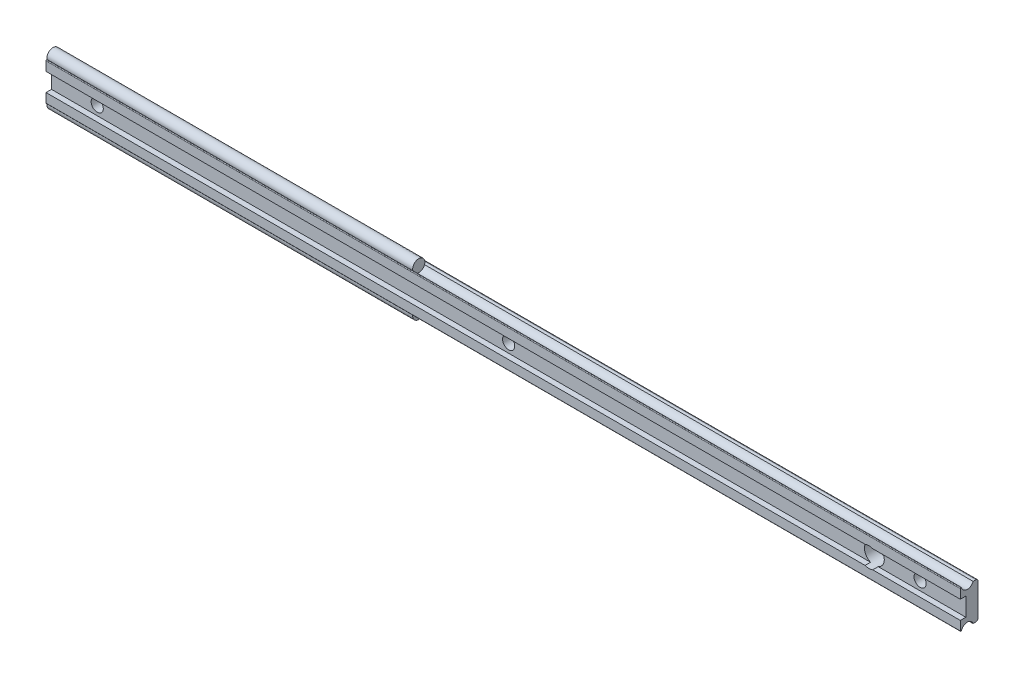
ISO-10303-21;
HEADER;
FILE_DESCRIPTION(('STEP AP214'),'2;1');
FILE_NAME('part.step','',(''),(''),'','','');
FILE_SCHEMA(('AUTOMOTIVE_DESIGN { 1 0 10303 214 1 1 1 1 }'));
ENDSEC;
DATA;
#1=APPLICATION_CONTEXT('core data for automotive mechanical design processes');
#2=APPLICATION_PROTOCOL_DEFINITION('international standard','automotive_design',2000,#1);
#3=PRODUCT_CONTEXT('',#1,'mechanical');
#4=PRODUCT('Part','Part','',(#3));
#5=PRODUCT_RELATED_PRODUCT_CATEGORY('part','',(#4));
#6=PRODUCT_DEFINITION_FORMATION('','',#4);
#7=PRODUCT_DEFINITION_CONTEXT('part definition',#1,'design');
#8=PRODUCT_DEFINITION('design','',#6,#7);
#9=PRODUCT_DEFINITION_SHAPE('','',#8);
#10=(LENGTH_UNIT() NAMED_UNIT(*) SI_UNIT(.MILLI.,.METRE.));
#11=(NAMED_UNIT(*) PLANE_ANGLE_UNIT() SI_UNIT($,.RADIAN.));
#12=(NAMED_UNIT(*) SI_UNIT($,.STERADIAN.) SOLID_ANGLE_UNIT());
#13=UNCERTAINTY_MEASURE_WITH_UNIT(LENGTH_MEASURE(1.E-05),#10,'distance_accuracy_value','');
#14=(GEOMETRIC_REPRESENTATION_CONTEXT(3) GLOBAL_UNCERTAINTY_ASSIGNED_CONTEXT((#13)) GLOBAL_UNIT_ASSIGNED_CONTEXT((#10,
#11,#12)) REPRESENTATION_CONTEXT('',''));
#15=CARTESIAN_POINT('',(0.,0.,0.));
#16=DIRECTION('',(0.,0.,1.));
#17=DIRECTION('',(1.,0.,0.));
#18=AXIS2_PLACEMENT_3D('',#15,#16,#17);
#19=CARTESIAN_POINT('',(-15.,-6.65000008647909,3.5000001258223));
#20=DIRECTION('',(1.,0.,0.));
#21=DIRECTION('',(0.,0.,-1.));
#22=AXIS2_PLACEMENT_3D('',#19,#20,#21);
#23=CYLINDRICAL_SURFACE('',#22,2.00000010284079);
#24=DIRECTION('',(1.,0.,0.));
#25=VECTOR('',#24,1.);
#26=CARTESIAN_POINT('',(-15.,-6.19000011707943,5.4463814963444));
#27=LINE('',#26,#25);
#28=CARTESIAN_POINT('',(105.,-6.19000011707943,5.4463814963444));
#29=VERTEX_POINT('',#28);
#30=CARTESIAN_POINT('',(285.,-6.19000011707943,5.4463814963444));
#31=VERTEX_POINT('',#30);
#32=EDGE_CURVE('E36',#29,#31,#27,.T.);
#33=ORIENTED_EDGE('',*,*,#32,.F.);
#34=CARTESIAN_POINT('',(105.,-6.65000008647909,3.5000001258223));
#35=DIRECTION('',(-1.,0.,0.));
#36=DIRECTION('',(0.,0.,1.));
#37=AXIS2_PLACEMENT_3D('',#34,#35,#36);
#38=CIRCLE('',#37,2.00000010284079);
#39=CARTESIAN_POINT('',(105.,-6.00000004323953,1.60857199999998));
#40=VERTEX_POINT('',#39);
#41=EDGE_CURVE('E31',#29,#40,#38,.T.);
#42=ORIENTED_EDGE('',*,*,#41,.T.);
#43=DIRECTION('',(1.,0.,0.));
#44=VECTOR('',#43,1.);
#45=CARTESIAN_POINT('',(-15.,-6.00000004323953,1.60857199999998));
#46=LINE('',#45,#44);
#47=CARTESIAN_POINT('',(285.,-6.00000004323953,1.60857199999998));
#48=VERTEX_POINT('',#47);
#49=EDGE_CURVE('E181',#40,#48,#46,.T.);
#50=ORIENTED_EDGE('',*,*,#49,.T.);
#51=CARTESIAN_POINT('',(285.,-6.65000008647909,3.5000001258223));
#52=DIRECTION('',(-1.,0.,0.));
#53=DIRECTION('',(0.,0.,1.));
#54=AXIS2_PLACEMENT_3D('',#51,#52,#53);
#55=CIRCLE('',#54,2.00000010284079);
#56=EDGE_CURVE('E267',#31,#48,#55,.T.);
#57=ORIENTED_EDGE('',*,*,#56,.F.);
#58=EDGE_LOOP('',(#33,#42,#50,#57));
#59=FACE_BOUND('',#58,.T.);
#60=ADVANCED_FACE('F14',(#59),#23,.F.);
#61=CARTESIAN_POINT('',(-15.,6.65000008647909,3.5000001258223));
#62=DIRECTION('',(1.,0.,0.));
#63=DIRECTION('',(0.,0.,-1.));
#64=AXIS2_PLACEMENT_3D('',#61,#62,#63);
#65=CYLINDRICAL_SURFACE('',#64,2.00000010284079);
#66=DIRECTION('',(1.,0.,0.));
#67=VECTOR('',#66,1.);
#68=CARTESIAN_POINT('',(-15.,6.00000004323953,1.60857199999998));
#69=LINE('',#68,#67);
#70=CARTESIAN_POINT('',(105.,6.00000004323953,1.60857199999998));
#71=VERTEX_POINT('',#70);
#72=CARTESIAN_POINT('',(285.,6.00000004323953,1.60857199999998));
#73=VERTEX_POINT('',#72);
#74=EDGE_CURVE('E348',#71,#73,#69,.T.);
#75=ORIENTED_EDGE('',*,*,#74,.F.);
#76=CARTESIAN_POINT('',(105.,6.65000008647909,3.5000001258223));
#77=DIRECTION('',(-1.,0.,0.));
#78=DIRECTION('',(0.,0.,1.));
#79=AXIS2_PLACEMENT_3D('',#76,#77,#78);
#80=CIRCLE('',#79,2.00000010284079);
#81=CARTESIAN_POINT('',(105.,6.19000011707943,5.4463814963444));
#82=VERTEX_POINT('',#81);
#83=EDGE_CURVE('E194',#71,#82,#80,.T.);
#84=ORIENTED_EDGE('',*,*,#83,.T.);
#85=DIRECTION('',(1.,0.,0.));
#86=VECTOR('',#85,1.);
#87=CARTESIAN_POINT('',(-15.,6.19000011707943,5.4463814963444));
#88=LINE('',#87,#86);
#89=CARTESIAN_POINT('',(285.,6.19000011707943,5.4463814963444));
#90=VERTEX_POINT('',#89);
#91=EDGE_CURVE('E344',#82,#90,#88,.T.);
#92=ORIENTED_EDGE('',*,*,#91,.T.);
#93=CARTESIAN_POINT('',(285.,6.65000008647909,3.5000001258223));
#94=DIRECTION('',(-1.,0.,0.));
#95=DIRECTION('',(0.,0.,-1.));
#96=AXIS2_PLACEMENT_3D('',#93,#94,#95);
#97=CIRCLE('',#96,2.00000010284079);
#98=EDGE_CURVE('E237',#73,#90,#97,.T.);
#99=ORIENTED_EDGE('',*,*,#98,.F.);
#100=EDGE_LOOP('',(#75,#84,#92,#99));
#101=FACE_BOUND('',#100,.T.);
#102=ADVANCED_FACE('F409',(#101),#65,.F.);
#103=CARTESIAN_POINT('',(-15.,-3.00000011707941,5.79999999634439));
#104=DIRECTION('',(0.,1.,0.));
#105=DIRECTION('',(0.,0.,1.));
#106=AXIS2_PLACEMENT_3D('',#103,#104,#105);
#107=PLANE('',#106);
#108=DIRECTION('',(0.,0.,-1.));
#109=VECTOR('',#108,1.);
#110=CARTESIAN_POINT('',(256.24999971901,-3.00000011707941,5.7999999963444));
#111=LINE('',#110,#109);
#112=CARTESIAN_POINT('',(256.24999971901,-3.00000011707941,5.7999999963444));
#113=VERTEX_POINT('',#112);
#114=CARTESIAN_POINT('',(256.24999971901,-3.00000011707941,3.99999999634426));
#115=VERTEX_POINT('',#114);
#116=EDGE_CURVE('E224',#113,#115,#111,.T.);
#117=ORIENTED_EDGE('',*,*,#116,.F.);
#118=DIRECTION('',(1.,0.,0.));
#119=VECTOR('',#118,1.);
#120=CARTESIAN_POINT('',(-15.,-3.00000011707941,5.79999999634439));
#121=LINE('',#120,#119);
#122=CARTESIAN_POINT('',(285.,-3.00000011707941,5.79999999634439));
#123=VERTEX_POINT('',#122);
#124=EDGE_CURVE('E324',#113,#123,#121,.T.);
#125=ORIENTED_EDGE('',*,*,#124,.T.);
#126=DIRECTION('',(0.,0.,1.));
#127=VECTOR('',#126,1.);
#128=CARTESIAN_POINT('',(285.,-3.00000011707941,5.79999999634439));
#129=LINE('',#128,#127);
#130=CARTESIAN_POINT('',(285.,-3.00000011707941,3.99999999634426));
#131=VERTEX_POINT('',#130);
#132=EDGE_CURVE('E255',#131,#123,#129,.T.);
#133=ORIENTED_EDGE('',*,*,#132,.F.);
#134=DIRECTION('',(1.,0.,0.));
#135=VECTOR('',#134,1.);
#136=CARTESIAN_POINT('',(-15.,-3.00000011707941,3.99999999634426));
#137=LINE('',#136,#135);
#138=EDGE_CURVE('E328',#115,#131,#137,.T.);
#139=ORIENTED_EDGE('',*,*,#138,.F.);
#140=EDGE_LOOP('',(#117,#125,#133,#139));
#141=FACE_BOUND('',#140,.T.);
#142=ADVANCED_FACE('F416',(#141),#107,.T.);
#143=CARTESIAN_POINT('',(-15.,-3.00000011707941,3.99999999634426));
#144=DIRECTION('',(0.,0.,1.));
#145=DIRECTION('',(0.,-1.,0.));
#146=AXIS2_PLACEMENT_3D('',#143,#144,#145);
#147=PLANE('',#146);
#148=CARTESIAN_POINT('',(270.,0.,3.99999999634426));
#149=DIRECTION('',(0.,0.,1.));
#150=DIRECTION('',(0.,-1.,0.));
#151=AXIS2_PLACEMENT_3D('',#148,#149,#150);
#152=CIRCLE('',#151,2.);
#153=CARTESIAN_POINT('',(270.,-2.,3.99999999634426));
#154=VERTEX_POINT('',#153);
#155=EDGE_CURVE('E210',#154,#154,#152,.T.);
#156=ORIENTED_EDGE('',*,*,#155,.F.);
#157=EDGE_LOOP('',(#156));
#158=FACE_BOUND('',#157,.T.);
#159=CARTESIAN_POINT('',(255.,0.,3.99999999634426));
#160=DIRECTION('',(0.,0.,1.));
#161=DIRECTION('',(0.,-1.,0.));
#162=AXIS2_PLACEMENT_3D('',#159,#160,#161);
#163=CIRCLE('',#162,3.25);
#164=CARTESIAN_POINT('',(256.24999971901,3.00000011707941,3.99999999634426));
#165=VERTEX_POINT('',#164);
#166=EDGE_CURVE('E222',#115,#165,#163,.T.);
#167=ORIENTED_EDGE('',*,*,#166,.F.);
#168=ORIENTED_EDGE('',*,*,#138,.T.);
#169=DIRECTION('',(0.,-1.,0.));
#170=VECTOR('',#169,1.);
#171=CARTESIAN_POINT('',(285.,-3.00000011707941,3.99999999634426));
#172=LINE('',#171,#170);
#173=CARTESIAN_POINT('',(285.,3.00000011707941,3.99999999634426));
#174=VERTEX_POINT('',#173);
#175=EDGE_CURVE('E252',#174,#131,#172,.T.);
#176=ORIENTED_EDGE('',*,*,#175,.F.);
#177=DIRECTION('',(1.,0.,0.));
#178=VECTOR('',#177,1.);
#179=CARTESIAN_POINT('',(-15.,3.00000011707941,3.99999999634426));
#180=LINE('',#179,#178);
#181=EDGE_CURVE('E332',#165,#174,#180,.T.);
#182=ORIENTED_EDGE('',*,*,#181,.F.);
#183=EDGE_LOOP('',(#167,#168,#176,#182));
#184=FACE_BOUND('',#183,.T.);
#185=ADVANCED_FACE('F364',(#158,#184),#147,.T.);
#186=CARTESIAN_POINT('',(-15.,3.00000011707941,5.7999999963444));
#187=DIRECTION('',(0.,-1.,0.));
#188=DIRECTION('',(0.,0.,-1.));
#189=AXIS2_PLACEMENT_3D('',#186,#187,#188);
#190=PLANE('',#189);
#191=DIRECTION('',(0.,0.,-1.));
#192=VECTOR('',#191,1.);
#193=CARTESIAN_POINT('',(253.75000028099,3.00000011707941,5.7999999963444));
#194=LINE('',#193,#192);
#195=CARTESIAN_POINT('',(253.75000028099,3.00000011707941,5.7999999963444));
#196=VERTEX_POINT('',#195);
#197=CARTESIAN_POINT('',(253.75000028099,3.00000011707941,3.99999999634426));
#198=VERTEX_POINT('',#197);
#199=EDGE_CURVE('E227',#196,#198,#194,.T.);
#200=ORIENTED_EDGE('',*,*,#199,.F.);
#201=DIRECTION('',(1.,0.,0.));
#202=VECTOR('',#201,1.);
#203=CARTESIAN_POINT('',(-15.,3.00000011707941,5.7999999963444));
#204=LINE('',#203,#202);
#205=CARTESIAN_POINT('',(-15.,3.00000011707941,5.7999999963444));
#206=VERTEX_POINT('',#205);
#207=EDGE_CURVE('E333',#206,#196,#204,.T.);
#208=ORIENTED_EDGE('',*,*,#207,.F.);
#209=DIRECTION('',(0.,0.,-1.));
#210=VECTOR('',#209,1.);
#211=CARTESIAN_POINT('',(-15.,3.00000011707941,5.7999999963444));
#212=LINE('',#211,#210);
#213=CARTESIAN_POINT('',(-15.,3.00000011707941,3.99999999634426));
#214=VERTEX_POINT('',#213);
#215=EDGE_CURVE('E293',#206,#214,#212,.T.);
#216=ORIENTED_EDGE('',*,*,#215,.T.);
#217=EDGE_CURVE('E329',#214,#198,#180,.T.);
#218=ORIENTED_EDGE('',*,*,#217,.T.);
#219=EDGE_LOOP('',(#200,#208,#216,#218));
#220=FACE_BOUND('',#219,.T.);
#221=ADVANCED_FACE('F372',(#220),#190,.T.);
#222=CARTESIAN_POINT('',(-15.,5.30000004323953,0.7));
#223=DIRECTION('',(1.,0.,0.));
#224=DIRECTION('',(0.,0.,-1.));
#225=AXIS2_PLACEMENT_3D('',#222,#223,#224);
#226=CYLINDRICAL_SURFACE('',#225,0.7);
#227=CARTESIAN_POINT('',(285.,5.30000004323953,0.7));
#228=DIRECTION('',(1.,0.,0.));
#229=DIRECTION('',(0.,0.,-1.));
#230=AXIS2_PLACEMENT_3D('',#227,#228,#229);
#231=CIRCLE('',#230,0.7);
#232=CARTESIAN_POINT('',(285.,5.30000004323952,0.));
#233=VERTEX_POINT('',#232);
#234=CARTESIAN_POINT('',(285.,6.00000004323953,0.7));
#235=VERTEX_POINT('',#234);
#236=EDGE_CURVE('E231',#233,#235,#231,.T.);
#237=ORIENTED_EDGE('',*,*,#236,.F.);
#238=DIRECTION('',(1.,0.,0.));
#239=VECTOR('',#238,1.);
#240=CARTESIAN_POINT('',(-15.,5.30000004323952,0.));
#241=LINE('',#240,#239);
#242=CARTESIAN_POINT('',(-15.,5.30000004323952,0.));
#243=VERTEX_POINT('',#242);
#244=EDGE_CURVE('E9',#243,#233,#241,.T.);
#245=ORIENTED_EDGE('',*,*,#244,.F.);
#246=CARTESIAN_POINT('',(-15.,5.30000004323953,0.7));
#247=DIRECTION('',(1.,0.,0.));
#248=DIRECTION('',(0.,0.,-1.));
#249=AXIS2_PLACEMENT_3D('',#246,#247,#248);
#250=CIRCLE('',#249,0.7);
#251=CARTESIAN_POINT('',(-15.,6.00000004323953,0.7));
#252=VERTEX_POINT('',#251);
#253=EDGE_CURVE('E279',#243,#252,#250,.T.);
#254=ORIENTED_EDGE('',*,*,#253,.T.);
#255=DIRECTION('',(1.,0.,0.));
#256=VECTOR('',#255,1.);
#257=CARTESIAN_POINT('',(-15.,6.00000004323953,0.7));
#258=LINE('',#257,#256);
#259=EDGE_CURVE('E312',#252,#235,#258,.T.);
#260=ORIENTED_EDGE('',*,*,#259,.T.);
#261=EDGE_LOOP('',(#237,#245,#254,#260));
#262=FACE_BOUND('',#261,.T.);
#263=ADVANCED_FACE('F16',(#262),#226,.T.);
#264=CARTESIAN_POINT('',(-15.,-5.30000004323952,0.));
#265=DIRECTION('',(0.,0.,-1.));
#266=DIRECTION('',(-1.,0.,0.));
#267=AXIS2_PLACEMENT_3D('',#264,#265,#266);
#268=PLANE('',#267);
#269=CARTESIAN_POINT('',(270.,0.,0.));
#270=DIRECTION('',(0.,0.,-1.));
#271=DIRECTION('',(-1.,0.,0.));
#272=AXIS2_PLACEMENT_3D('',#269,#270,#271);
#273=CIRCLE('',#272,2.);
#274=CARTESIAN_POINT('',(268.,0.,0.));
#275=VERTEX_POINT('',#274);
#276=EDGE_CURVE('E201',#275,#275,#273,.T.);
#277=ORIENTED_EDGE('',*,*,#276,.F.);
#278=EDGE_LOOP('',(#277));
#279=FACE_BOUND('',#278,.T.);
#280=CARTESIAN_POINT('',(135.,0.,0.));
#281=DIRECTION('',(0.,0.,-1.));
#282=DIRECTION('',(-1.,0.,0.));
#283=AXIS2_PLACEMENT_3D('',#280,#281,#282);
#284=CIRCLE('',#283,2.);
#285=CARTESIAN_POINT('',(133.,0.,0.));
#286=VERTEX_POINT('',#285);
#287=EDGE_CURVE('E205',#286,#286,#284,.T.);
#288=ORIENTED_EDGE('',*,*,#287,.F.);
#289=EDGE_LOOP('',(#288));
#290=FACE_BOUND('',#289,.T.);
#291=CARTESIAN_POINT('',(0.,0.,0.));
#292=DIRECTION('',(0.,0.,-1.));
#293=DIRECTION('',(-1.,0.,0.));
#294=AXIS2_PLACEMENT_3D('',#291,#292,#293);
#295=CIRCLE('',#294,2.);
#296=CARTESIAN_POINT('',(-2.,0.,0.));
#297=VERTEX_POINT('',#296);
#298=EDGE_CURVE('E196',#297,#297,#295,.T.);
#299=ORIENTED_EDGE('',*,*,#298,.F.);
#300=EDGE_LOOP('',(#299));
#301=FACE_BOUND('',#300,.T.);
#302=CARTESIAN_POINT('',(255.,0.,0.));
#303=DIRECTION('',(0.,0.,-1.));
#304=DIRECTION('',(-1.,0.,0.));
#305=AXIS2_PLACEMENT_3D('',#302,#303,#304);
#306=CIRCLE('',#305,3.25);
#307=CARTESIAN_POINT('',(251.75,0.,0.));
#308=VERTEX_POINT('',#307);
#309=EDGE_CURVE('E213',#308,#308,#306,.T.);
#310=ORIENTED_EDGE('',*,*,#309,.F.);
#311=EDGE_LOOP('',(#310));
#312=FACE_BOUND('',#311,.T.);
#313=DIRECTION('',(0.,1.,0.));
#314=VECTOR('',#313,1.);
#315=CARTESIAN_POINT('',(285.,-5.30000004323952,0.));
#316=LINE('',#315,#314);
#317=CARTESIAN_POINT('',(285.,-5.30000004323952,0.));
#318=VERTEX_POINT('',#317);
#319=EDGE_CURVE('E276',#318,#233,#316,.T.);
#320=ORIENTED_EDGE('',*,*,#319,.F.);
#321=DIRECTION('',(1.,0.,0.));
#322=VECTOR('',#321,1.);
#323=CARTESIAN_POINT('',(-15.,-5.30000004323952,0.));
#324=LINE('',#323,#322);
#325=CARTESIAN_POINT('',(-15.,-5.30000004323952,0.));
#326=VERTEX_POINT('',#325);
#327=EDGE_CURVE('E23',#326,#318,#324,.T.);
#328=ORIENTED_EDGE('',*,*,#327,.F.);
#329=DIRECTION('',(0.,1.,0.));
#330=VECTOR('',#329,1.);
#331=CARTESIAN_POINT('',(-15.,-5.30000004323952,0.));
#332=LINE('',#331,#330);
#333=EDGE_CURVE('E310',#326,#243,#332,.T.);
#334=ORIENTED_EDGE('',*,*,#333,.T.);
#335=ORIENTED_EDGE('',*,*,#244,.T.);
#336=EDGE_LOOP('',(#320,#328,#334,#335));
#337=FACE_BOUND('',#336,.T.);
#338=ADVANCED_FACE('F401',(#279,#290,#301,#312,#337),#268,.T.);
#339=CARTESIAN_POINT('',(-15.,-5.30000004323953,0.7));
#340=DIRECTION('',(1.,0.,0.));
#341=DIRECTION('',(0.,0.,-1.));
#342=AXIS2_PLACEMENT_3D('',#339,#340,#341);
#343=CYLINDRICAL_SURFACE('',#342,0.7);
#344=CARTESIAN_POINT('',(285.,-5.30000004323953,0.7));
#345=DIRECTION('',(1.,0.,0.));
#346=DIRECTION('',(0.,0.,1.));
#347=AXIS2_PLACEMENT_3D('',#344,#345,#346);
#348=CIRCLE('',#347,0.7);
#349=CARTESIAN_POINT('',(285.,-6.00000004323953,0.7));
#350=VERTEX_POINT('',#349);
#351=EDGE_CURVE('E273',#350,#318,#348,.T.);
#352=ORIENTED_EDGE('',*,*,#351,.F.);
#353=DIRECTION('',(1.,0.,0.));
#354=VECTOR('',#353,1.);
#355=CARTESIAN_POINT('',(-15.,-6.00000004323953,0.7));
#356=LINE('',#355,#354);
#357=CARTESIAN_POINT('',(-15.,-6.00000004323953,0.7));
#358=VERTEX_POINT('',#357);
#359=EDGE_CURVE('E185',#358,#350,#356,.T.);
#360=ORIENTED_EDGE('',*,*,#359,.F.);
#361=CARTESIAN_POINT('',(-15.,-5.30000004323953,0.7));
#362=DIRECTION('',(1.,0.,0.));
#363=DIRECTION('',(0.,0.,1.));
#364=AXIS2_PLACEMENT_3D('',#361,#362,#363);
#365=CIRCLE('',#364,0.7);
#366=EDGE_CURVE('E173',#358,#326,#365,.T.);
#367=ORIENTED_EDGE('',*,*,#366,.T.);
#368=ORIENTED_EDGE('',*,*,#327,.T.);
#369=EDGE_LOOP('',(#352,#360,#367,#368));
#370=FACE_BOUND('',#369,.T.);
#371=ADVANCED_FACE('F404',(#370),#343,.T.);
#372=CARTESIAN_POINT('',(-15.,-6.00000004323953,1.60857199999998));
#373=DIRECTION('',(0.,-1.,0.));
#374=DIRECTION('',(-1.,0.,0.));
#375=AXIS2_PLACEMENT_3D('',#372,#373,#374);
#376=PLANE('',#375);
#377=DIRECTION('',(0.,0.,-1.));
#378=VECTOR('',#377,1.);
#379=CARTESIAN_POINT('',(285.,-6.00000004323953,1.60857199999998));
#380=LINE('',#379,#378);
#381=EDGE_CURVE('E270',#48,#350,#380,.T.);
#382=ORIENTED_EDGE('',*,*,#381,.F.);
#383=ORIENTED_EDGE('',*,*,#49,.F.);
#384=CARTESIAN_POINT('',(-15.,-6.00000004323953,1.60857199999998));
#385=VERTEX_POINT('',#384);
#386=EDGE_CURVE('E178',#385,#40,#46,.T.);
#387=ORIENTED_EDGE('',*,*,#386,.F.);
#388=DIRECTION('',(0.,0.,-1.));
#389=VECTOR('',#388,1.);
#390=CARTESIAN_POINT('',(-15.,-6.00000004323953,1.60857199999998));
#391=LINE('',#390,#389);
#392=EDGE_CURVE('E164',#385,#358,#391,.T.);
#393=ORIENTED_EDGE('',*,*,#392,.T.);
#394=ORIENTED_EDGE('',*,*,#359,.T.);
#395=EDGE_LOOP('',(#382,#383,#387,#393,#394));
#396=FACE_BOUND('',#395,.T.);
#397=ADVANCED_FACE('F180',(#396),#376,.T.);
#398=CARTESIAN_POINT('',(-15.,-6.19000011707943,5.4463814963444));
#399=DIRECTION('',(0.,-1.,0.));
#400=DIRECTION('',(-1.,0.,0.));
#401=AXIS2_PLACEMENT_3D('',#398,#399,#400);
#402=PLANE('',#401);
#403=DIRECTION('',(0.,0.,-1.));
#404=VECTOR('',#403,1.);
#405=CARTESIAN_POINT('',(285.,-6.19000011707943,5.4463814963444));
#406=LINE('',#405,#404);
#407=CARTESIAN_POINT('',(285.,-6.19000011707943,5.59999999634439));
#408=VERTEX_POINT('',#407);
#409=EDGE_CURVE('E264',#408,#31,#406,.T.);
#410=ORIENTED_EDGE('',*,*,#409,.F.);
#411=DIRECTION('',(1.,0.,0.));
#412=VECTOR('',#411,1.);
#413=CARTESIAN_POINT('',(-15.,-6.19000011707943,5.59999999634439));
#414=LINE('',#413,#412);
#415=CARTESIAN_POINT('',(-15.,-6.19000011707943,5.59999999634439));
#416=VERTEX_POINT('',#415);
#417=EDGE_CURVE('E317',#416,#408,#414,.T.);
#418=ORIENTED_EDGE('',*,*,#417,.F.);
#419=DIRECTION('',(0.,0.,-1.));
#420=VECTOR('',#419,1.);
#421=CARTESIAN_POINT('',(-15.,-6.19000011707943,5.4463814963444));
#422=LINE('',#421,#420);
#423=CARTESIAN_POINT('',(-15.,-6.19000011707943,5.4463814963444));
#424=VERTEX_POINT('',#423);
#425=EDGE_CURVE('E175',#416,#424,#422,.T.);
#426=ORIENTED_EDGE('',*,*,#425,.T.);
#427=EDGE_CURVE('E189',#424,#29,#27,.T.);
#428=ORIENTED_EDGE('',*,*,#427,.T.);
#429=ORIENTED_EDGE('',*,*,#32,.T.);
#430=EDGE_LOOP('',(#410,#418,#426,#428,#429));
#431=FACE_BOUND('',#430,.T.);
#432=ADVANCED_FACE('F422',(#431),#402,.T.);
#433=CARTESIAN_POINT('',(-15.,-5.99000011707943,5.59999999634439));
#434=DIRECTION('',(1.,0.,0.));
#435=DIRECTION('',(0.,0.,-1.));
#436=AXIS2_PLACEMENT_3D('',#433,#434,#435);
#437=CYLINDRICAL_SURFACE('',#436,0.2);
#438=CARTESIAN_POINT('',(285.,-5.99000011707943,5.59999999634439));
#439=DIRECTION('',(1.,0.,0.));
#440=DIRECTION('',(0.,0.,-1.));
#441=AXIS2_PLACEMENT_3D('',#438,#439,#440);
#442=CIRCLE('',#441,0.2);
#443=CARTESIAN_POINT('',(285.,-5.99000011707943,5.79999999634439));
#444=VERTEX_POINT('',#443);
#445=EDGE_CURVE('E261',#444,#408,#442,.T.);
#446=ORIENTED_EDGE('',*,*,#445,.F.);
#447=DIRECTION('',(1.,0.,0.));
#448=VECTOR('',#447,1.);
#449=CARTESIAN_POINT('',(-15.,-5.99000011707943,5.79999999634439));
#450=LINE('',#449,#448);
#451=CARTESIAN_POINT('',(-15.,-5.99000011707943,5.79999999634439));
#452=VERTEX_POINT('',#451);
#453=EDGE_CURVE('E319',#452,#444,#450,.T.);
#454=ORIENTED_EDGE('',*,*,#453,.F.);
#455=CARTESIAN_POINT('',(-15.,-5.99000011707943,5.59999999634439));
#456=DIRECTION('',(1.,0.,0.));
#457=DIRECTION('',(0.,0.,-1.));
#458=AXIS2_PLACEMENT_3D('',#455,#456,#457);
#459=CIRCLE('',#458,0.2);
#460=EDGE_CURVE('E305',#452,#416,#459,.T.);
#461=ORIENTED_EDGE('',*,*,#460,.T.);
#462=ORIENTED_EDGE('',*,*,#417,.T.);
#463=EDGE_LOOP('',(#446,#454,#461,#462));
#464=FACE_BOUND('',#463,.T.);
#465=ADVANCED_FACE('F425',(#464),#437,.T.);
#466=CARTESIAN_POINT('',(-15.,-3.00000011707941,5.79999999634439));
#467=DIRECTION('',(0.,0.,1.));
#468=DIRECTION('',(1.,0.,0.));
#469=AXIS2_PLACEMENT_3D('',#466,#467,#468);
#470=PLANE('',#469);
#471=CARTESIAN_POINT('',(255.,0.,5.7999999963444));
#472=DIRECTION('',(0.,0.,-1.));
#473=DIRECTION('',(-1.,0.,0.));
#474=AXIS2_PLACEMENT_3D('',#471,#472,#473);
#475=CIRCLE('',#474,3.25);
#476=CARTESIAN_POINT('',(253.75000028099,-3.00000011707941,5.7999999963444));
#477=VERTEX_POINT('',#476);
#478=EDGE_CURVE('E216',#113,#477,#475,.T.);
#479=ORIENTED_EDGE('',*,*,#478,.T.);
#480=CARTESIAN_POINT('',(-15.,-3.00000011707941,5.79999999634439));
#481=VERTEX_POINT('',#480);
#482=EDGE_CURVE('E321',#481,#477,#121,.T.);
#483=ORIENTED_EDGE('',*,*,#482,.F.);
#484=DIRECTION('',(0.,-1.,0.));
#485=VECTOR('',#484,1.);
#486=CARTESIAN_POINT('',(-15.,-3.00000011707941,5.79999999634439));
#487=LINE('',#486,#485);
#488=EDGE_CURVE('E302',#481,#452,#487,.T.);
#489=ORIENTED_EDGE('',*,*,#488,.T.);
#490=ORIENTED_EDGE('',*,*,#453,.T.);
#491=DIRECTION('',(0.,-1.,0.));
#492=VECTOR('',#491,1.);
#493=CARTESIAN_POINT('',(285.,-3.00000011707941,5.79999999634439));
#494=LINE('',#493,#492);
#495=EDGE_CURVE('E258',#123,#444,#494,.T.);
#496=ORIENTED_EDGE('',*,*,#495,.F.);
#497=ORIENTED_EDGE('',*,*,#124,.F.);
#498=EDGE_LOOP('',(#479,#483,#489,#490,#496,#497));
#499=FACE_BOUND('',#498,.T.);
#500=ADVANCED_FACE('F429',(#499),#470,.T.);
#501=DIRECTION('',(0.,0.,-1.));
#502=VECTOR('',#501,1.);
#503=CARTESIAN_POINT('',(253.75000028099,-3.00000011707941,5.7999999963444));
#504=LINE('',#503,#502);
#505=CARTESIAN_POINT('',(253.75000028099,-3.00000011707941,3.99999999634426));
#506=VERTEX_POINT('',#505);
#507=EDGE_CURVE('E229',#506,#477,#504,.F.);
#508=ORIENTED_EDGE('',*,*,#507,.F.);
#509=CARTESIAN_POINT('',(-15.,-3.00000011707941,3.99999999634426));
#510=VERTEX_POINT('',#509);
#511=EDGE_CURVE('E325',#510,#506,#137,.T.);
#512=ORIENTED_EDGE('',*,*,#511,.F.);
#513=DIRECTION('',(0.,0.,1.));
#514=VECTOR('',#513,1.);
#515=CARTESIAN_POINT('',(-15.,-3.00000011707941,5.79999999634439));
#516=LINE('',#515,#514);
#517=EDGE_CURVE('E299',#510,#481,#516,.T.);
#518=ORIENTED_EDGE('',*,*,#517,.T.);
#519=ORIENTED_EDGE('',*,*,#482,.T.);
#520=EDGE_LOOP('',(#508,#512,#518,#519));
#521=FACE_BOUND('',#520,.T.);
#522=ADVANCED_FACE('F362',(#521),#107,.T.);
#523=CARTESIAN_POINT('',(135.,0.,3.99999999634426));
#524=DIRECTION('',(0.,0.,1.));
#525=DIRECTION('',(0.,-1.,0.));
#526=AXIS2_PLACEMENT_3D('',#523,#524,#525);
#527=CIRCLE('',#526,2.);
#528=CARTESIAN_POINT('',(135.,-2.,3.99999999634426));
#529=VERTEX_POINT('',#528);
#530=EDGE_CURVE('E18',#529,#529,#527,.T.);
#531=ORIENTED_EDGE('',*,*,#530,.F.);
#532=EDGE_LOOP('',(#531));
#533=FACE_BOUND('',#532,.T.);
#534=CARTESIAN_POINT('',(0.,0.,3.99999999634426));
#535=DIRECTION('',(0.,0.,1.));
#536=DIRECTION('',(0.,-1.,0.));
#537=AXIS2_PLACEMENT_3D('',#534,#535,#536);
#538=CIRCLE('',#537,2.);
#539=CARTESIAN_POINT('',(0.,-2.,3.99999999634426));
#540=VERTEX_POINT('',#539);
#541=EDGE_CURVE('E204',#540,#540,#538,.T.);
#542=ORIENTED_EDGE('',*,*,#541,.F.);
#543=EDGE_LOOP('',(#542));
#544=FACE_BOUND('',#543,.T.);
#545=EDGE_CURVE('E225',#198,#506,#163,.T.);
#546=ORIENTED_EDGE('',*,*,#545,.F.);
#547=ORIENTED_EDGE('',*,*,#217,.F.);
#548=DIRECTION('',(0.,-1.,0.));
#549=VECTOR('',#548,1.);
#550=CARTESIAN_POINT('',(-15.,-3.00000011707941,3.99999999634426));
#551=LINE('',#550,#549);
#552=EDGE_CURVE('E296',#214,#510,#551,.T.);
#553=ORIENTED_EDGE('',*,*,#552,.T.);
#554=ORIENTED_EDGE('',*,*,#511,.T.);
#555=EDGE_LOOP('',(#546,#547,#553,#554));
#556=FACE_BOUND('',#555,.T.);
#557=ADVANCED_FACE('F358',(#533,#544,#556),#147,.T.);
#558=DIRECTION('',(0.,0.,-1.));
#559=VECTOR('',#558,1.);
#560=CARTESIAN_POINT('',(256.24999971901,3.00000011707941,5.7999999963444));
#561=LINE('',#560,#559);
#562=CARTESIAN_POINT('',(256.24999971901,3.00000011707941,5.7999999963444));
#563=VERTEX_POINT('',#562);
#564=EDGE_CURVE('E220',#165,#563,#561,.F.);
#565=ORIENTED_EDGE('',*,*,#564,.F.);
#566=ORIENTED_EDGE('',*,*,#181,.T.);
#567=DIRECTION('',(0.,0.,-1.));
#568=VECTOR('',#567,1.);
#569=CARTESIAN_POINT('',(285.,3.00000011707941,5.7999999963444));
#570=LINE('',#569,#568);
#571=CARTESIAN_POINT('',(285.,3.00000011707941,5.7999999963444));
#572=VERTEX_POINT('',#571);
#573=EDGE_CURVE('E249',#572,#174,#570,.T.);
#574=ORIENTED_EDGE('',*,*,#573,.F.);
#575=EDGE_CURVE('E336',#563,#572,#204,.T.);
#576=ORIENTED_EDGE('',*,*,#575,.F.);
#577=EDGE_LOOP('',(#565,#566,#574,#576));
#578=FACE_BOUND('',#577,.T.);
#579=ADVANCED_FACE('F361',(#578),#190,.T.);
#580=CARTESIAN_POINT('',(-15.,3.00000011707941,5.7999999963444));
#581=DIRECTION('',(0.,0.,1.));
#582=DIRECTION('',(1.,0.,0.));
#583=AXIS2_PLACEMENT_3D('',#580,#581,#582);
#584=PLANE('',#583);
#585=EDGE_CURVE('E217',#196,#563,#475,.T.);
#586=ORIENTED_EDGE('',*,*,#585,.T.);
#587=ORIENTED_EDGE('',*,*,#575,.T.);
#588=DIRECTION('',(0.,-1.,0.));
#589=VECTOR('',#588,1.);
#590=CARTESIAN_POINT('',(285.,3.00000011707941,5.7999999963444));
#591=LINE('',#590,#589);
#592=CARTESIAN_POINT('',(285.,5.99000011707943,5.7999999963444));
#593=VERTEX_POINT('',#592);
#594=EDGE_CURVE('E246',#593,#572,#591,.T.);
#595=ORIENTED_EDGE('',*,*,#594,.F.);
#596=DIRECTION('',(1.,0.,0.));
#597=VECTOR('',#596,1.);
#598=CARTESIAN_POINT('',(-15.,5.99000011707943,5.7999999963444));
#599=LINE('',#598,#597);
#600=CARTESIAN_POINT('',(-15.,5.99000011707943,5.7999999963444));
#601=VERTEX_POINT('',#600);
#602=EDGE_CURVE('E337',#601,#593,#599,.T.);
#603=ORIENTED_EDGE('',*,*,#602,.F.);
#604=DIRECTION('',(0.,-1.,0.));
#605=VECTOR('',#604,1.);
#606=CARTESIAN_POINT('',(-15.,3.00000011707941,5.7999999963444));
#607=LINE('',#606,#605);
#608=EDGE_CURVE('E290',#601,#206,#607,.T.);
#609=ORIENTED_EDGE('',*,*,#608,.T.);
#610=ORIENTED_EDGE('',*,*,#207,.T.);
#611=EDGE_LOOP('',(#586,#587,#595,#603,#609,#610));
#612=FACE_BOUND('',#611,.T.);
#613=ADVANCED_FACE('F378',(#612),#584,.T.);
#614=CARTESIAN_POINT('',(-15.,5.99000011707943,5.5999999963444));
#615=DIRECTION('',(1.,0.,0.));
#616=DIRECTION('',(0.,0.,-1.));
#617=AXIS2_PLACEMENT_3D('',#614,#615,#616);
#618=CYLINDRICAL_SURFACE('',#617,0.2);
#619=CARTESIAN_POINT('',(285.,5.99000011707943,5.5999999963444));
#620=DIRECTION('',(1.,0.,0.));
#621=DIRECTION('',(0.,0.,1.));
#622=AXIS2_PLACEMENT_3D('',#619,#620,#621);
#623=CIRCLE('',#622,0.2);
#624=CARTESIAN_POINT('',(285.,6.19000011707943,5.5999999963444));
#625=VERTEX_POINT('',#624);
#626=EDGE_CURVE('E243',#625,#593,#623,.T.);
#627=ORIENTED_EDGE('',*,*,#626,.F.);
#628=DIRECTION('',(1.,0.,0.));
#629=VECTOR('',#628,1.);
#630=CARTESIAN_POINT('',(-15.,6.19000011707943,5.5999999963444));
#631=LINE('',#630,#629);
#632=CARTESIAN_POINT('',(-15.,6.19000011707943,5.5999999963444));
#633=VERTEX_POINT('',#632);
#634=EDGE_CURVE('E339',#633,#625,#631,.T.);
#635=ORIENTED_EDGE('',*,*,#634,.F.);
#636=CARTESIAN_POINT('',(-15.,5.99000011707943,5.5999999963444));
#637=DIRECTION('',(1.,0.,0.));
#638=DIRECTION('',(0.,0.,1.));
#639=AXIS2_PLACEMENT_3D('',#636,#637,#638);
#640=CIRCLE('',#639,0.2);
#641=EDGE_CURVE('E287',#633,#601,#640,.T.);
#642=ORIENTED_EDGE('',*,*,#641,.T.);
#643=ORIENTED_EDGE('',*,*,#602,.T.);
#644=EDGE_LOOP('',(#627,#635,#642,#643));
#645=FACE_BOUND('',#644,.T.);
#646=ADVANCED_FACE('F382',(#645),#618,.T.);
#647=CARTESIAN_POINT('',(-15.,6.19000011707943,5.4463814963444));
#648=DIRECTION('',(0.,1.,0.));
#649=DIRECTION('',(1.,0.,0.));
#650=AXIS2_PLACEMENT_3D('',#647,#648,#649);
#651=PLANE('',#650);
#652=DIRECTION('',(0.,0.,1.));
#653=VECTOR('',#652,1.);
#654=CARTESIAN_POINT('',(285.,6.19000011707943,5.4463814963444));
#655=LINE('',#654,#653);
#656=EDGE_CURVE('E240',#90,#625,#655,.T.);
#657=ORIENTED_EDGE('',*,*,#656,.F.);
#658=ORIENTED_EDGE('',*,*,#91,.F.);
#659=CARTESIAN_POINT('',(-15.,6.19000011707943,5.4463814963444));
#660=VERTEX_POINT('',#659);
#661=EDGE_CURVE('E341',#660,#82,#88,.T.);
#662=ORIENTED_EDGE('',*,*,#661,.F.);
#663=DIRECTION('',(0.,0.,1.));
#664=VECTOR('',#663,1.);
#665=CARTESIAN_POINT('',(-15.,6.19000011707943,5.4463814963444));
#666=LINE('',#665,#664);
#667=EDGE_CURVE('E284',#660,#633,#666,.T.);
#668=ORIENTED_EDGE('',*,*,#667,.T.);
#669=ORIENTED_EDGE('',*,*,#634,.T.);
#670=EDGE_LOOP('',(#657,#658,#662,#668,#669));
#671=FACE_BOUND('',#670,.T.);
#672=ADVANCED_FACE('F386',(#671),#651,.T.);
#673=CARTESIAN_POINT('',(-15.,6.00000004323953,1.60857199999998));
#674=DIRECTION('',(0.,1.,0.));
#675=DIRECTION('',(1.,0.,0.));
#676=AXIS2_PLACEMENT_3D('',#673,#674,#675);
#677=PLANE('',#676);
#678=DIRECTION('',(0.,0.,1.));
#679=VECTOR('',#678,1.);
#680=CARTESIAN_POINT('',(285.,6.00000004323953,1.60857199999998));
#681=LINE('',#680,#679);
#682=EDGE_CURVE('E234',#235,#73,#681,.T.);
#683=ORIENTED_EDGE('',*,*,#682,.F.);
#684=ORIENTED_EDGE('',*,*,#259,.F.);
#685=DIRECTION('',(0.,0.,1.));
#686=VECTOR('',#685,1.);
#687=CARTESIAN_POINT('',(-15.,6.00000004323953,1.60857199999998));
#688=LINE('',#687,#686);
#689=CARTESIAN_POINT('',(-15.,6.00000004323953,1.60857199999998));
#690=VERTEX_POINT('',#689);
#691=EDGE_CURVE('E282',#252,#690,#688,.T.);
#692=ORIENTED_EDGE('',*,*,#691,.T.);
#693=EDGE_CURVE('E345',#690,#71,#69,.T.);
#694=ORIENTED_EDGE('',*,*,#693,.T.);
#695=ORIENTED_EDGE('',*,*,#74,.T.);
#696=EDGE_LOOP('',(#683,#684,#692,#694,#695));
#697=FACE_BOUND('',#696,.T.);
#698=ADVANCED_FACE('F445',(#697),#677,.T.);
#699=CARTESIAN_POINT('',(-15.,5.30000004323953,0.7));
#700=DIRECTION('',(1.,0.,0.));
#701=DIRECTION('',(0.,0.,-1.));
#702=AXIS2_PLACEMENT_3D('',#699,#700,#701);
#703=PLANE('',#702);
#704=ORIENTED_EDGE('',*,*,#253,.F.);
#705=ORIENTED_EDGE('',*,*,#333,.F.);
#706=ORIENTED_EDGE('',*,*,#366,.F.);
#707=ORIENTED_EDGE('',*,*,#392,.F.);
#708=CARTESIAN_POINT('',(-15.,-6.65000008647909,3.5000001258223));
#709=DIRECTION('',(-1.,0.,0.));
#710=DIRECTION('',(0.,0.,1.));
#711=AXIS2_PLACEMENT_3D('',#708,#709,#710);
#712=CIRCLE('',#711,2.00000010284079);
#713=EDGE_CURVE('E170',#385,#424,#712,.T.);
#714=ORIENTED_EDGE('',*,*,#713,.T.);
#715=ORIENTED_EDGE('',*,*,#425,.F.);
#716=ORIENTED_EDGE('',*,*,#460,.F.);
#717=ORIENTED_EDGE('',*,*,#488,.F.);
#718=ORIENTED_EDGE('',*,*,#517,.F.);
#719=ORIENTED_EDGE('',*,*,#552,.F.);
#720=ORIENTED_EDGE('',*,*,#215,.F.);
#721=ORIENTED_EDGE('',*,*,#608,.F.);
#722=ORIENTED_EDGE('',*,*,#641,.F.);
#723=ORIENTED_EDGE('',*,*,#667,.F.);
#724=CARTESIAN_POINT('',(-15.,6.65000008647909,3.5000001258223));
#725=DIRECTION('',(-1.,0.,0.));
#726=DIRECTION('',(0.,0.,1.));
#727=AXIS2_PLACEMENT_3D('',#724,#725,#726);
#728=CIRCLE('',#727,2.00000010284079);
#729=EDGE_CURVE('E198',#660,#690,#728,.T.);
#730=ORIENTED_EDGE('',*,*,#729,.T.);
#731=ORIENTED_EDGE('',*,*,#691,.F.);
#732=EDGE_LOOP('',(#704,#705,#706,#707,#714,#715,#716,#717,#718,#719,#720,#721,#722,#723,#730,#731));
#733=FACE_BOUND('',#732,.T.);
#734=ADVANCED_FACE('F167',(#733),#703,.F.);
#735=CARTESIAN_POINT('',(285.,5.30000004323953,0.7));
#736=DIRECTION('',(1.,0.,0.));
#737=DIRECTION('',(0.,0.,-1.));
#738=AXIS2_PLACEMENT_3D('',#735,#736,#737);
#739=PLANE('',#738);
#740=ORIENTED_EDGE('',*,*,#236,.T.);
#741=ORIENTED_EDGE('',*,*,#682,.T.);
#742=ORIENTED_EDGE('',*,*,#98,.T.);
#743=ORIENTED_EDGE('',*,*,#656,.T.);
#744=ORIENTED_EDGE('',*,*,#626,.T.);
#745=ORIENTED_EDGE('',*,*,#594,.T.);
#746=ORIENTED_EDGE('',*,*,#573,.T.);
#747=ORIENTED_EDGE('',*,*,#175,.T.);
#748=ORIENTED_EDGE('',*,*,#132,.T.);
#749=ORIENTED_EDGE('',*,*,#495,.T.);
#750=ORIENTED_EDGE('',*,*,#445,.T.);
#751=ORIENTED_EDGE('',*,*,#409,.T.);
#752=ORIENTED_EDGE('',*,*,#56,.T.);
#753=ORIENTED_EDGE('',*,*,#381,.T.);
#754=ORIENTED_EDGE('',*,*,#351,.T.);
#755=ORIENTED_EDGE('',*,*,#319,.T.);
#756=EDGE_LOOP('',(#740,#741,#742,#743,#744,#745,#746,#747,#748,#749,#750,#751,#752,#753,#754,#755));
#757=FACE_BOUND('',#756,.T.);
#758=ADVANCED_FACE('F406',(#757),#739,.T.);
#759=CARTESIAN_POINT('',(255.,0.,5.7999999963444));
#760=DIRECTION('',(0.,0.,-1.));
#761=DIRECTION('',(-1.,0.,0.));
#762=AXIS2_PLACEMENT_3D('',#759,#760,#761);
#763=CYLINDRICAL_SURFACE('',#762,3.25);
#764=ORIENTED_EDGE('',*,*,#507,.T.);
#765=ORIENTED_EDGE('',*,*,#478,.F.);
#766=ORIENTED_EDGE('',*,*,#116,.T.);
#767=ORIENTED_EDGE('',*,*,#166,.T.);
#768=ORIENTED_EDGE('',*,*,#564,.T.);
#769=ORIENTED_EDGE('',*,*,#585,.F.);
#770=ORIENTED_EDGE('',*,*,#199,.T.);
#771=ORIENTED_EDGE('',*,*,#545,.T.);
#772=EDGE_LOOP('',(#764,#765,#766,#767,#768,#769,#770,#771));
#773=FACE_BOUND('',#772,.T.);
#774=ORIENTED_EDGE('',*,*,#309,.T.);
#775=EDGE_LOOP('',(#774));
#776=FACE_BOUND('',#775,.T.);
#777=ADVANCED_FACE('F477',(#773,#776),#763,.F.);
#778=CARTESIAN_POINT('',(0.,0.,10.));
#779=DIRECTION('',(0.,0.,-1.));
#780=DIRECTION('',(-1.,0.,0.));
#781=AXIS2_PLACEMENT_3D('',#778,#779,#780);
#782=CYLINDRICAL_SURFACE('',#781,2.);
#783=ORIENTED_EDGE('',*,*,#541,.T.);
#784=EDGE_LOOP('',(#783));
#785=FACE_BOUND('',#784,.T.);
#786=ORIENTED_EDGE('',*,*,#298,.T.);
#787=EDGE_LOOP('',(#786));
#788=FACE_BOUND('',#787,.T.);
#789=ADVANCED_FACE('F474',(#785,#788),#782,.F.);
#790=CARTESIAN_POINT('',(135.,0.,10.));
#791=DIRECTION('',(0.,0.,-1.));
#792=DIRECTION('',(-1.,0.,0.));
#793=AXIS2_PLACEMENT_3D('',#790,#791,#792);
#794=CYLINDRICAL_SURFACE('',#793,2.);
#795=ORIENTED_EDGE('',*,*,#530,.T.);
#796=EDGE_LOOP('',(#795));
#797=FACE_BOUND('',#796,.T.);
#798=ORIENTED_EDGE('',*,*,#287,.T.);
#799=EDGE_LOOP('',(#798));
#800=FACE_BOUND('',#799,.T.);
#801=ADVANCED_FACE('F355',(#797,#800),#794,.F.);
#802=CARTESIAN_POINT('',(270.,0.,10.));
#803=DIRECTION('',(0.,0.,-1.));
#804=DIRECTION('',(-1.,0.,0.));
#805=AXIS2_PLACEMENT_3D('',#802,#803,#804);
#806=CYLINDRICAL_SURFACE('',#805,2.);
#807=ORIENTED_EDGE('',*,*,#155,.T.);
#808=EDGE_LOOP('',(#807));
#809=FACE_BOUND('',#808,.T.);
#810=ORIENTED_EDGE('',*,*,#276,.T.);
#811=EDGE_LOOP('',(#810));
#812=FACE_BOUND('',#811,.T.);
#813=ADVANCED_FACE('F465',(#809,#812),#806,.F.);
#814=CARTESIAN_POINT('',(105.,6.65000008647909,3.5000001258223));
#815=DIRECTION('',(-1.,0.,0.));
#816=DIRECTION('',(0.,0.,1.));
#817=AXIS2_PLACEMENT_3D('',#814,#815,#816);
#818=CYLINDRICAL_SURFACE('',#817,2.00000010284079);
#819=ORIENTED_EDGE('',*,*,#729,.F.);
#820=ORIENTED_EDGE('',*,*,#661,.T.);
#821=EDGE_CURVE('E197',#82,#71,#80,.T.);
#822=ORIENTED_EDGE('',*,*,#821,.T.);
#823=ORIENTED_EDGE('',*,*,#693,.F.);
#824=EDGE_LOOP('',(#819,#820,#822,#823));
#825=FACE_BOUND('',#824,.T.);
#826=ADVANCED_FACE('F393',(#825),#818,.T.);
#827=CARTESIAN_POINT('',(105.,6.65000008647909,3.5000001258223));
#828=DIRECTION('',(-1.,0.,0.));
#829=DIRECTION('',(0.,0.,1.));
#830=AXIS2_PLACEMENT_3D('',#827,#828,#829);
#831=PLANE('',#830);
#832=ORIENTED_EDGE('',*,*,#83,.F.);
#833=ORIENTED_EDGE('',*,*,#821,.F.);
#834=EDGE_LOOP('',(#832,#833));
#835=FACE_BOUND('',#834,.T.);
#836=ADVANCED_FACE('F455',(#835),#831,.F.);
#837=CARTESIAN_POINT('',(105.,-6.65000008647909,3.5000001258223));
#838=DIRECTION('',(-1.,0.,0.));
#839=DIRECTION('',(0.,0.,1.));
#840=AXIS2_PLACEMENT_3D('',#837,#838,#839);
#841=CYLINDRICAL_SURFACE('',#840,2.00000010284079);
#842=ORIENTED_EDGE('',*,*,#713,.F.);
#843=ORIENTED_EDGE('',*,*,#386,.T.);
#844=EDGE_CURVE('E190',#40,#29,#38,.T.);
#845=ORIENTED_EDGE('',*,*,#844,.T.);
#846=ORIENTED_EDGE('',*,*,#427,.F.);
#847=EDGE_LOOP('',(#842,#843,#845,#846));
#848=FACE_BOUND('',#847,.T.);
#849=ADVANCED_FACE('F188',(#848),#841,.T.);
#850=CARTESIAN_POINT('',(105.,-6.65000008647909,3.5000001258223));
#851=DIRECTION('',(-1.,0.,0.));
#852=DIRECTION('',(0.,0.,1.));
#853=AXIS2_PLACEMENT_3D('',#850,#851,#852);
#854=PLANE('',#853);
#855=ORIENTED_EDGE('',*,*,#41,.F.);
#856=ORIENTED_EDGE('',*,*,#844,.F.);
#857=EDGE_LOOP('',(#855,#856));
#858=FACE_BOUND('',#857,.T.);
#859=ADVANCED_FACE('F463',(#858),#854,.F.);
#860=CLOSED_SHELL('',(#60,#102,#142,#185,#221,#263,#338,#371,#397,#432,#465,#500,#522,#557,#579,
#613,#646,#672,#698,#734,#758,#777,#789,#801,#813,#826,#836,#849,#859));
#861=MANIFOLD_SOLID_BREP('B1',#860);
#862=ADVANCED_BREP_SHAPE_REPRESENTATION('',(#18,#861),#14);
#863=SHAPE_DEFINITION_REPRESENTATION(#9,#862);
ENDSEC;
END-ISO-10303-21;
